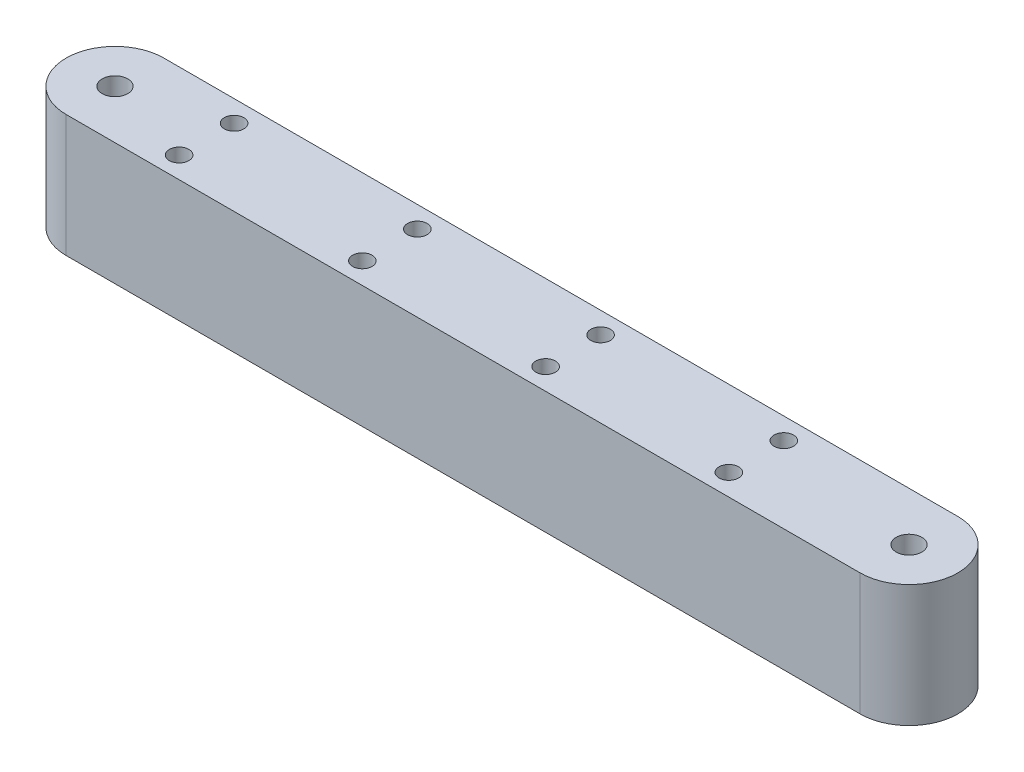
from build123d import *

# Parameters (mm, degrees)
SKETCH_1_R          = 2.1
EXTRUDE_1_DEPTH     = 20
SKETCH_2_R          = 1.6
CUT_EXTRUDE_1_DEPTH = 77.111759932


with BuildPart() as part:
    # Sketch 1 → Extrude 1 (new body)
    with BuildSketch(Plane(origin=(0, 0, 0), x_dir=(1, 0, 0), z_dir=(0, 1, 0))):
        with BuildLine():
            Line((-65, 8), (65, 8))
            ThreePointArc((65, 8), (73, 0), (65, -8))
            Line((65, -8), (-65, -8))
            ThreePointArc((-65, -8), (-73, 0), (-65, 8))
        make_face()
        with Locations(Location((-65, 0, 0), (0, 0, 270))):
            Circle(SKETCH_1_R, mode=Mode.SUBTRACT)
        with Locations(Location((65, 0, 0), (0, 0, 270))):
            Circle(SKETCH_1_R, mode=Mode.SUBTRACT)
    extrude(amount=EXTRUDE_1_DEPTH)

    # Sketch 2 → Cut-Extrude 1 (cut, through all)
    with BuildSketch(Plane(origin=(0, 20, 0), x_dir=(1, 0, 0), z_dir=(0, 1, 0))):
        with Locations(Location((-50, 4.5, 0), (0, 0, 270))):
            Circle(SKETCH_2_R)
        with Locations(Location((-20, 4.5, 0), (0, 0, 270))):
            Circle(SKETCH_2_R)
        with Locations(Location((10, 4.5, 0), (0, 0, 270))):
            Circle(SKETCH_2_R)
        with Locations(Location((40, 4.5, 0), (0, 0, 270))):
            Circle(SKETCH_2_R)
        with Locations(Location((-20, -4.5, 0), (0, 0, 270))):
            Circle(SKETCH_2_R)
        with Locations(Location((10, -4.5, 0), (0, 0, 270))):
            Circle(SKETCH_2_R)
        with Locations(Location((40, -4.5, 0), (0, 0, 270))):
            Circle(SKETCH_2_R)
        with Locations(Location((-50, -4.5, 0), (0, 0, 270))):
            Circle(SKETCH_2_R)
    extrude(amount=-CUT_EXTRUDE_1_DEPTH, mode=Mode.SUBTRACT)


solid = part.part
